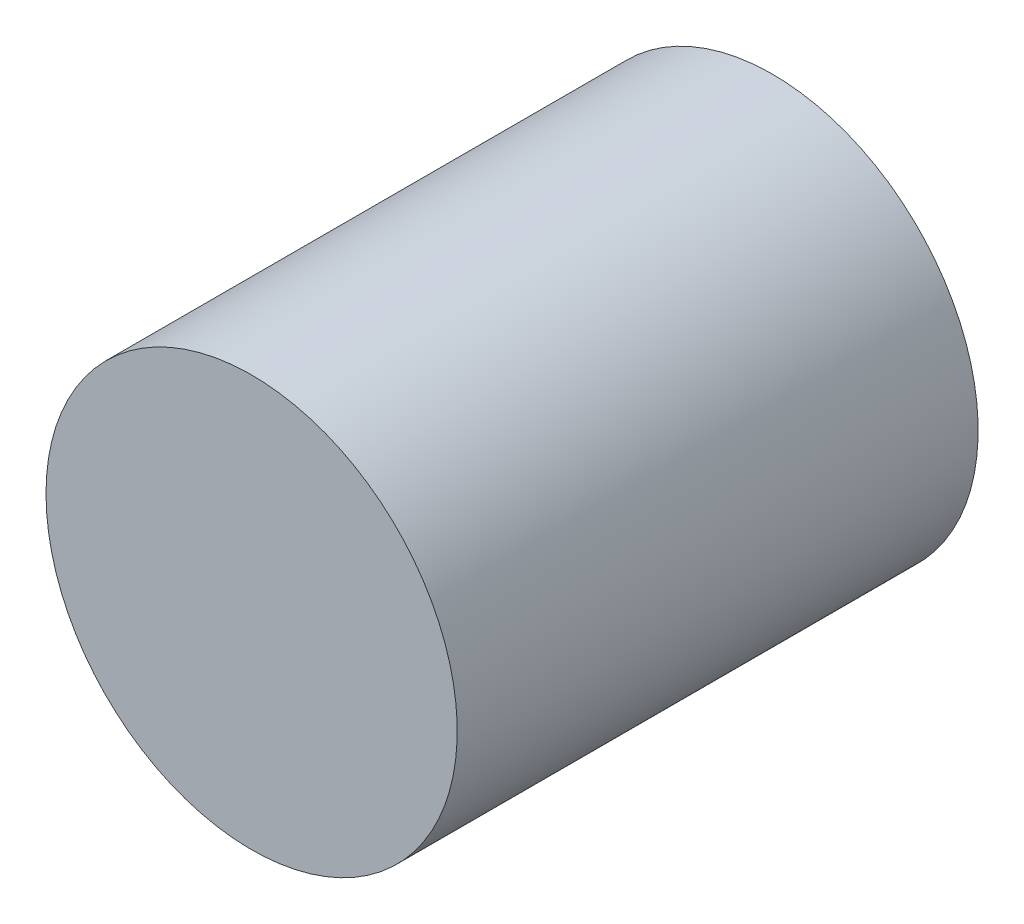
ISO-10303-21;
HEADER;
FILE_DESCRIPTION(('STEP AP214'),'2;1');
FILE_NAME('part.step','',(''),(''),'','','');
FILE_SCHEMA(('AUTOMOTIVE_DESIGN { 1 0 10303 214 1 1 1 1 }'));
ENDSEC;
DATA;
#1=APPLICATION_CONTEXT('core data for automotive mechanical design processes');
#2=APPLICATION_PROTOCOL_DEFINITION('international standard','automotive_design',2000,#1);
#3=PRODUCT_CONTEXT('',#1,'mechanical');
#4=PRODUCT('Part','Part','',(#3));
#5=PRODUCT_RELATED_PRODUCT_CATEGORY('part','',(#4));
#6=PRODUCT_DEFINITION_FORMATION('','',#4);
#7=PRODUCT_DEFINITION_CONTEXT('part definition',#1,'design');
#8=PRODUCT_DEFINITION('design','',#6,#7);
#9=PRODUCT_DEFINITION_SHAPE('','',#8);
#10=(LENGTH_UNIT() NAMED_UNIT(*) SI_UNIT(.MILLI.,.METRE.));
#11=(NAMED_UNIT(*) PLANE_ANGLE_UNIT() SI_UNIT($,.RADIAN.));
#12=(NAMED_UNIT(*) SI_UNIT($,.STERADIAN.) SOLID_ANGLE_UNIT());
#13=UNCERTAINTY_MEASURE_WITH_UNIT(LENGTH_MEASURE(1.E-05),#10,'distance_accuracy_value','');
#14=(GEOMETRIC_REPRESENTATION_CONTEXT(3) GLOBAL_UNCERTAINTY_ASSIGNED_CONTEXT((#13)) GLOBAL_UNIT_ASSIGNED_CONTEXT((#10,
#11,#12)) REPRESENTATION_CONTEXT('',''));
#15=CARTESIAN_POINT('',(0.,0.,0.));
#16=DIRECTION('',(0.,0.,1.));
#17=DIRECTION('',(1.,0.,0.));
#18=AXIS2_PLACEMENT_3D('',#15,#16,#17);
#19=CARTESIAN_POINT('',(0.2999994,0.,0.));
#20=DIRECTION('',(0.,0.,-1.));
#21=DIRECTION('',(-1.,0.,0.));
#22=AXIS2_PLACEMENT_3D('',#19,#20,#21);
#23=PLANE('',#22);
#24=CARTESIAN_POINT('',(0.,0.,0.));
#25=DIRECTION('',(0.,0.,-1.));
#26=DIRECTION('',(-1.,0.,0.));
#27=AXIS2_PLACEMENT_3D('',#24,#25,#26);
#28=CIRCLE('',#27,0.2999994);
#29=CARTESIAN_POINT('',(-0.2999994,0.,0.));
#30=VERTEX_POINT('',#29);
#31=EDGE_CURVE('E17',#30,#30,#28,.F.);
#32=ORIENTED_EDGE('',*,*,#31,.F.);
#33=EDGE_LOOP('',(#32));
#34=FACE_BOUND('',#33,.T.);
#35=ADVANCED_FACE('F14',(#34),#23,.T.);
#36=CARTESIAN_POINT('',(0.2999994,0.,0.76000102));
#37=DIRECTION('',(0.,0.,-1.));
#38=DIRECTION('',(-1.,0.,0.));
#39=AXIS2_PLACEMENT_3D('',#36,#37,#38);
#40=PLANE('',#39);
#41=CARTESIAN_POINT('',(0.,0.,0.76000102));
#42=DIRECTION('',(0.,0.,-1.));
#43=DIRECTION('',(-1.,0.,0.));
#44=AXIS2_PLACEMENT_3D('',#41,#42,#43);
#45=CIRCLE('',#44,0.2999994);
#46=CARTESIAN_POINT('',(-0.2999994,0.,0.76000102));
#47=VERTEX_POINT('',#46);
#48=EDGE_CURVE('E10',#47,#47,#45,.T.);
#49=ORIENTED_EDGE('',*,*,#48,.F.);
#50=EDGE_LOOP('',(#49));
#51=FACE_BOUND('',#50,.T.);
#52=ADVANCED_FACE('F29',(#51),#40,.F.);
#53=CARTESIAN_POINT('',(0.,0.,0.));
#54=DIRECTION('',(0.,0.,-1.));
#55=DIRECTION('',(-1.,0.,0.));
#56=AXIS2_PLACEMENT_3D('',#53,#54,#55);
#57=CYLINDRICAL_SURFACE('',#56,0.2999994);
#58=ORIENTED_EDGE('',*,*,#48,.T.);
#59=EDGE_LOOP('',(#58));
#60=FACE_BOUND('',#59,.T.);
#61=ORIENTED_EDGE('',*,*,#31,.T.);
#62=EDGE_LOOP('',(#61));
#63=FACE_BOUND('',#62,.T.);
#64=ADVANCED_FACE('F26',(#60,#63),#57,.T.);
#65=CLOSED_SHELL('',(#35,#52,#64));
#66=MANIFOLD_SOLID_BREP('B1',#65);
#67=ADVANCED_BREP_SHAPE_REPRESENTATION('',(#18,#66),#14);
#68=SHAPE_DEFINITION_REPRESENTATION(#9,#67);
ENDSEC;
END-ISO-10303-21;
